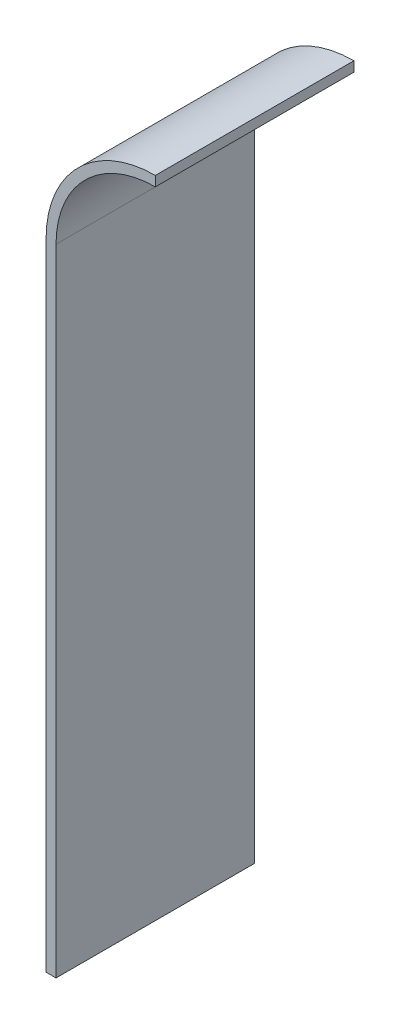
ISO-10303-21;
HEADER;
FILE_DESCRIPTION(('STEP AP214'),'2;1');
FILE_NAME('part.step','',(''),(''),'','','');
FILE_SCHEMA(('AUTOMOTIVE_DESIGN { 1 0 10303 214 1 1 1 1 }'));
ENDSEC;
DATA;
#1=APPLICATION_CONTEXT('core data for automotive mechanical design processes');
#2=APPLICATION_PROTOCOL_DEFINITION('international standard','automotive_design',2000,#1);
#3=PRODUCT_CONTEXT('',#1,'mechanical');
#4=PRODUCT('Part','Part','',(#3));
#5=PRODUCT_RELATED_PRODUCT_CATEGORY('part','',(#4));
#6=PRODUCT_DEFINITION_FORMATION('','',#4);
#7=PRODUCT_DEFINITION_CONTEXT('part definition',#1,'design');
#8=PRODUCT_DEFINITION('design','',#6,#7);
#9=PRODUCT_DEFINITION_SHAPE('','',#8);
#10=(LENGTH_UNIT() NAMED_UNIT(*) SI_UNIT(.MILLI.,.METRE.));
#11=(NAMED_UNIT(*) PLANE_ANGLE_UNIT() SI_UNIT($,.RADIAN.));
#12=(NAMED_UNIT(*) SI_UNIT($,.STERADIAN.) SOLID_ANGLE_UNIT());
#13=UNCERTAINTY_MEASURE_WITH_UNIT(LENGTH_MEASURE(1.E-05),#10,'distance_accuracy_value','');
#14=(GEOMETRIC_REPRESENTATION_CONTEXT(3) GLOBAL_UNCERTAINTY_ASSIGNED_CONTEXT((#13)) GLOBAL_UNIT_ASSIGNED_CONTEXT((#10,
#11,#12)) REPRESENTATION_CONTEXT('',''));
#15=CARTESIAN_POINT('',(0.,0.,0.));
#16=DIRECTION('',(0.,0.,1.));
#17=DIRECTION('',(1.,0.,0.));
#18=AXIS2_PLACEMENT_3D('',#15,#16,#17);
#19=CARTESIAN_POINT('',(0.,0.,20.));
#20=DIRECTION('',(0.,0.,-1.));
#21=DIRECTION('',(-1.,0.,0.));
#22=AXIS2_PLACEMENT_3D('',#19,#20,#21);
#23=CYLINDRICAL_SURFACE('',#22,10.);
#24=CARTESIAN_POINT('',(0.,0.,0.));
#25=DIRECTION('',(0.,0.,-1.));
#26=DIRECTION('',(1.,0.,0.));
#27=AXIS2_PLACEMENT_3D('',#24,#25,#26);
#28=CIRCLE('',#27,10.);
#29=CARTESIAN_POINT('',(-10.,0.,0.));
#30=VERTEX_POINT('',#29);
#31=CARTESIAN_POINT('',(0.,10.,0.));
#32=VERTEX_POINT('',#31);
#33=EDGE_CURVE('E115',#30,#32,#28,.T.);
#34=ORIENTED_EDGE('',*,*,#33,.T.);
#35=DIRECTION('',(0.,0.,-1.));
#36=VECTOR('',#35,1.);
#37=CARTESIAN_POINT('',(0.,10.,20.));
#38=LINE('',#37,#36);
#39=CARTESIAN_POINT('',(0.,10.,20.));
#40=VERTEX_POINT('',#39);
#41=EDGE_CURVE('E11',#40,#32,#38,.T.);
#42=ORIENTED_EDGE('',*,*,#41,.F.);
#43=CARTESIAN_POINT('',(0.,0.,20.));
#44=DIRECTION('',(0.,0.,-1.));
#45=DIRECTION('',(1.,0.,0.));
#46=AXIS2_PLACEMENT_3D('',#43,#44,#45);
#47=CIRCLE('',#46,10.);
#48=CARTESIAN_POINT('',(-10.,0.,20.));
#49=VERTEX_POINT('',#48);
#50=EDGE_CURVE('E125',#49,#40,#47,.T.);
#51=ORIENTED_EDGE('',*,*,#50,.F.);
#52=DIRECTION('',(0.,0.,-1.));
#53=VECTOR('',#52,1.);
#54=CARTESIAN_POINT('',(-10.,0.,20.));
#55=LINE('',#54,#53);
#56=EDGE_CURVE('E111',#49,#30,#55,.T.);
#57=ORIENTED_EDGE('',*,*,#56,.T.);
#58=EDGE_LOOP('',(#34,#42,#51,#57));
#59=FACE_BOUND('',#58,.T.);
#60=ADVANCED_FACE('F31',(#59),#23,.F.);
#61=CARTESIAN_POINT('',(0.,10.,20.));
#62=DIRECTION('',(-1.,0.,0.));
#63=DIRECTION('',(0.,-1.,0.));
#64=AXIS2_PLACEMENT_3D('',#61,#62,#63);
#65=PLANE('',#64);
#66=DIRECTION('',(0.,1.,0.));
#67=VECTOR('',#66,1.);
#68=CARTESIAN_POINT('',(0.,10.,0.));
#69=LINE('',#68,#67);
#70=CARTESIAN_POINT('',(0.,11.,0.));
#71=VERTEX_POINT('',#70);
#72=EDGE_CURVE('E118',#32,#71,#69,.T.);
#73=ORIENTED_EDGE('',*,*,#72,.T.);
#74=DIRECTION('',(0.,0.,-1.));
#75=VECTOR('',#74,1.);
#76=CARTESIAN_POINT('',(0.,11.,20.));
#77=LINE('',#76,#75);
#78=CARTESIAN_POINT('',(0.,11.,20.));
#79=VERTEX_POINT('',#78);
#80=EDGE_CURVE('E39',#79,#71,#77,.T.);
#81=ORIENTED_EDGE('',*,*,#80,.F.);
#82=DIRECTION('',(0.,1.,0.));
#83=VECTOR('',#82,1.);
#84=CARTESIAN_POINT('',(0.,10.,20.));
#85=LINE('',#84,#83);
#86=EDGE_CURVE('E84',#40,#79,#85,.T.);
#87=ORIENTED_EDGE('',*,*,#86,.F.);
#88=ORIENTED_EDGE('',*,*,#41,.T.);
#89=EDGE_LOOP('',(#73,#81,#87,#88));
#90=FACE_BOUND('',#89,.T.);
#91=ADVANCED_FACE('F149',(#90),#65,.F.);
#92=CARTESIAN_POINT('',(0.,0.,20.));
#93=DIRECTION('',(0.,0.,-1.));
#94=DIRECTION('',(-1.,0.,0.));
#95=AXIS2_PLACEMENT_3D('',#92,#93,#94);
#96=CYLINDRICAL_SURFACE('',#95,11.);
#97=CARTESIAN_POINT('',(0.,0.,0.));
#98=DIRECTION('',(0.,0.,1.));
#99=DIRECTION('',(1.,0.,0.));
#100=AXIS2_PLACEMENT_3D('',#97,#98,#99);
#101=CIRCLE('',#100,11.);
#102=CARTESIAN_POINT('',(-11.,0.,0.));
#103=VERTEX_POINT('',#102);
#104=EDGE_CURVE('E120',#71,#103,#101,.T.);
#105=ORIENTED_EDGE('',*,*,#104,.T.);
#106=DIRECTION('',(0.,0.,-1.));
#107=VECTOR('',#106,1.);
#108=CARTESIAN_POINT('',(-11.,0.,20.));
#109=LINE('',#108,#107);
#110=CARTESIAN_POINT('',(-11.,0.,20.));
#111=VERTEX_POINT('',#110);
#112=EDGE_CURVE('E106',#111,#103,#109,.T.);
#113=ORIENTED_EDGE('',*,*,#112,.F.);
#114=CARTESIAN_POINT('',(0.,0.,20.));
#115=DIRECTION('',(0.,0.,1.));
#116=DIRECTION('',(1.,0.,0.));
#117=AXIS2_PLACEMENT_3D('',#114,#115,#116);
#118=CIRCLE('',#117,11.);
#119=EDGE_CURVE('E97',#79,#111,#118,.T.);
#120=ORIENTED_EDGE('',*,*,#119,.F.);
#121=ORIENTED_EDGE('',*,*,#80,.T.);
#122=EDGE_LOOP('',(#105,#113,#120,#121));
#123=FACE_BOUND('',#122,.T.);
#124=ADVANCED_FACE('F131',(#123),#96,.T.);
#125=CARTESIAN_POINT('',(-11.,0.,20.));
#126=DIRECTION('',(1.,0.,0.));
#127=DIRECTION('',(0.,1.,0.));
#128=AXIS2_PLACEMENT_3D('',#125,#126,#127);
#129=PLANE('',#128);
#130=DIRECTION('',(0.,-1.,0.));
#131=VECTOR('',#130,1.);
#132=CARTESIAN_POINT('',(-11.,0.,0.));
#133=LINE('',#132,#131);
#134=CARTESIAN_POINT('',(-11.,-64.,0.));
#135=VERTEX_POINT('',#134);
#136=EDGE_CURVE('E105',#103,#135,#133,.T.);
#137=ORIENTED_EDGE('',*,*,#136,.T.);
#138=DIRECTION('',(0.,0.,-1.));
#139=VECTOR('',#138,1.);
#140=CARTESIAN_POINT('',(-11.,-64.,20.));
#141=LINE('',#140,#139);
#142=CARTESIAN_POINT('',(-11.,-64.,20.));
#143=VERTEX_POINT('',#142);
#144=EDGE_CURVE('E102',#143,#135,#141,.T.);
#145=ORIENTED_EDGE('',*,*,#144,.F.);
#146=DIRECTION('',(0.,-1.,0.));
#147=VECTOR('',#146,1.);
#148=CARTESIAN_POINT('',(-11.,0.,20.));
#149=LINE('',#148,#147);
#150=EDGE_CURVE('E91',#111,#143,#149,.T.);
#151=ORIENTED_EDGE('',*,*,#150,.F.);
#152=ORIENTED_EDGE('',*,*,#112,.T.);
#153=EDGE_LOOP('',(#137,#145,#151,#152));
#154=FACE_BOUND('',#153,.T.);
#155=ADVANCED_FACE('F103',(#154),#129,.F.);
#156=CARTESIAN_POINT('',(-9.99999999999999,-64.,20.));
#157=DIRECTION('',(0.,1.,0.));
#158=DIRECTION('',(0.,0.,1.));
#159=AXIS2_PLACEMENT_3D('',#156,#157,#158);
#160=PLANE('',#159);
#161=DIRECTION('',(1.,0.,0.));
#162=VECTOR('',#161,1.);
#163=CARTESIAN_POINT('',(-9.99999999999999,-64.,0.));
#164=LINE('',#163,#162);
#165=CARTESIAN_POINT('',(-9.99999999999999,-64.,0.));
#166=VERTEX_POINT('',#165);
#167=EDGE_CURVE('E70',#135,#166,#164,.T.);
#168=ORIENTED_EDGE('',*,*,#167,.T.);
#169=DIRECTION('',(0.,0.,-1.));
#170=VECTOR('',#169,1.);
#171=CARTESIAN_POINT('',(-9.99999999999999,-64.,20.));
#172=LINE('',#171,#170);
#173=CARTESIAN_POINT('',(-9.99999999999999,-64.,20.));
#174=VERTEX_POINT('',#173);
#175=EDGE_CURVE('E107',#174,#166,#172,.T.);
#176=ORIENTED_EDGE('',*,*,#175,.F.);
#177=DIRECTION('',(1.,0.,0.));
#178=VECTOR('',#177,1.);
#179=CARTESIAN_POINT('',(-9.99999999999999,-64.,20.));
#180=LINE('',#179,#178);
#181=EDGE_CURVE('E95',#143,#174,#180,.T.);
#182=ORIENTED_EDGE('',*,*,#181,.F.);
#183=ORIENTED_EDGE('',*,*,#144,.T.);
#184=EDGE_LOOP('',(#168,#176,#182,#183));
#185=FACE_BOUND('',#184,.T.);
#186=ADVANCED_FACE('F109',(#185),#160,.F.);
#187=CARTESIAN_POINT('',(-10.,0.,20.));
#188=DIRECTION('',(-1.,0.,0.));
#189=DIRECTION('',(0.,-1.,0.));
#190=AXIS2_PLACEMENT_3D('',#187,#188,#189);
#191=PLANE('',#190);
#192=DIRECTION('',(0.,1.,0.));
#193=VECTOR('',#192,1.);
#194=CARTESIAN_POINT('',(-10.,0.,0.));
#195=LINE('',#194,#193);
#196=EDGE_CURVE('E76',#166,#30,#195,.T.);
#197=ORIENTED_EDGE('',*,*,#196,.T.);
#198=ORIENTED_EDGE('',*,*,#56,.F.);
#199=DIRECTION('',(0.,1.,0.));
#200=VECTOR('',#199,1.);
#201=CARTESIAN_POINT('',(-10.,0.,20.));
#202=LINE('',#201,#200);
#203=EDGE_CURVE('E47',#174,#49,#202,.T.);
#204=ORIENTED_EDGE('',*,*,#203,.F.);
#205=ORIENTED_EDGE('',*,*,#175,.T.);
#206=EDGE_LOOP('',(#197,#198,#204,#205));
#207=FACE_BOUND('',#206,.T.);
#208=ADVANCED_FACE('F138',(#207),#191,.F.);
#209=CARTESIAN_POINT('',(0.,0.,20.));
#210=DIRECTION('',(0.,0.,1.));
#211=DIRECTION('',(1.,0.,0.));
#212=AXIS2_PLACEMENT_3D('',#209,#210,#211);
#213=PLANE('',#212);
#214=ORIENTED_EDGE('',*,*,#50,.T.);
#215=ORIENTED_EDGE('',*,*,#86,.T.);
#216=ORIENTED_EDGE('',*,*,#119,.T.);
#217=ORIENTED_EDGE('',*,*,#150,.T.);
#218=ORIENTED_EDGE('',*,*,#181,.T.);
#219=ORIENTED_EDGE('',*,*,#203,.T.);
#220=EDGE_LOOP('',(#214,#215,#216,#217,#218,#219));
#221=FACE_BOUND('',#220,.T.);
#222=ADVANCED_FACE('F93',(#221),#213,.T.);
#223=CARTESIAN_POINT('',(0.,0.,0.));
#224=DIRECTION('',(0.,0.,1.));
#225=DIRECTION('',(1.,0.,0.));
#226=AXIS2_PLACEMENT_3D('',#223,#224,#225);
#227=PLANE('',#226);
#228=ORIENTED_EDGE('',*,*,#33,.F.);
#229=ORIENTED_EDGE('',*,*,#196,.F.);
#230=ORIENTED_EDGE('',*,*,#167,.F.);
#231=ORIENTED_EDGE('',*,*,#136,.F.);
#232=ORIENTED_EDGE('',*,*,#104,.F.);
#233=ORIENTED_EDGE('',*,*,#72,.F.);
#234=EDGE_LOOP('',(#228,#229,#230,#231,#232,#233));
#235=FACE_BOUND('',#234,.T.);
#236=ADVANCED_FACE('F134',(#235),#227,.F.);
#237=CLOSED_SHELL('',(#60,#91,#124,#155,#186,#208,#222,#236));
#238=MANIFOLD_SOLID_BREP('B2',#237);
#239=ADVANCED_BREP_SHAPE_REPRESENTATION('',(#18,#238),#14);
#240=SHAPE_DEFINITION_REPRESENTATION(#9,#239);
ENDSEC;
END-ISO-10303-21;
